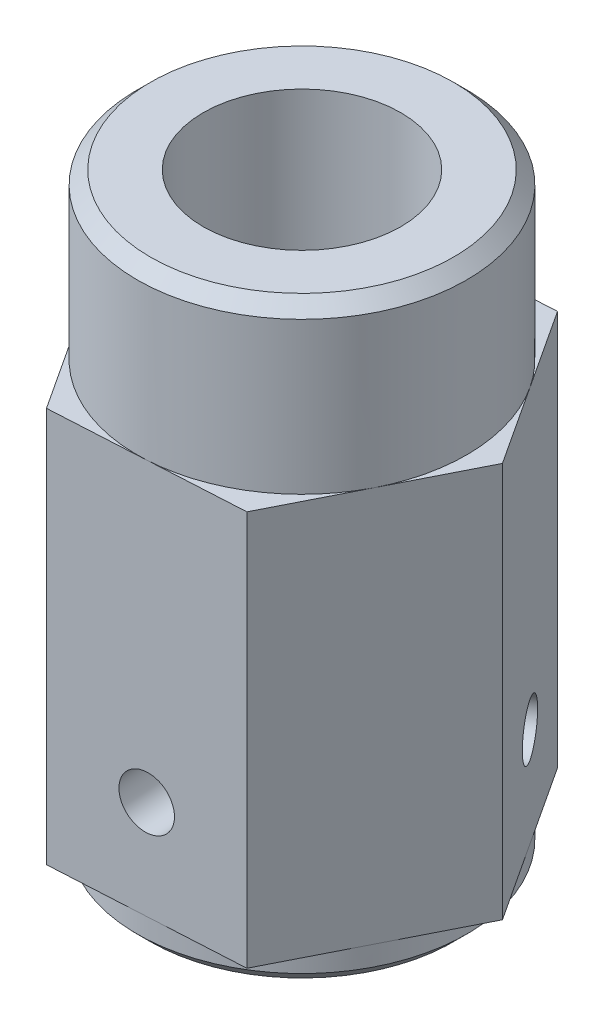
ISO-10303-21;
HEADER;
FILE_DESCRIPTION(('STEP AP214'),'2;1');
FILE_NAME('part.step','',(''),(''),'','','');
FILE_SCHEMA(('AUTOMOTIVE_DESIGN { 1 0 10303 214 1 1 1 1 }'));
ENDSEC;
DATA;
#1=APPLICATION_CONTEXT('core data for automotive mechanical design processes');
#2=APPLICATION_PROTOCOL_DEFINITION('international standard','automotive_design',2000,#1);
#3=PRODUCT_CONTEXT('',#1,'mechanical');
#4=PRODUCT('Part','Part','',(#3));
#5=PRODUCT_RELATED_PRODUCT_CATEGORY('part','',(#4));
#6=PRODUCT_DEFINITION_FORMATION('','',#4);
#7=PRODUCT_DEFINITION_CONTEXT('part definition',#1,'design');
#8=PRODUCT_DEFINITION('design','',#6,#7);
#9=PRODUCT_DEFINITION_SHAPE('','',#8);
#10=(LENGTH_UNIT() NAMED_UNIT(*) SI_UNIT(.MILLI.,.METRE.));
#11=(NAMED_UNIT(*) PLANE_ANGLE_UNIT() SI_UNIT($,.RADIAN.));
#12=(NAMED_UNIT(*) SI_UNIT($,.STERADIAN.) SOLID_ANGLE_UNIT());
#13=UNCERTAINTY_MEASURE_WITH_UNIT(LENGTH_MEASURE(1.E-05),#10,'distance_accuracy_value','');
#14=(GEOMETRIC_REPRESENTATION_CONTEXT(3) GLOBAL_UNCERTAINTY_ASSIGNED_CONTEXT((#13)) GLOBAL_UNIT_ASSIGNED_CONTEXT((#10,
#11,#12)) REPRESENTATION_CONTEXT('',''));
#15=CARTESIAN_POINT('',(0.,0.,0.));
#16=DIRECTION('',(0.,0.,1.));
#17=DIRECTION('',(1.,0.,0.));
#18=AXIS2_PLACEMENT_3D('',#15,#16,#17);
#19=CARTESIAN_POINT('',(0.,0.,0.));
#20=DIRECTION('',(0.,1.,0.));
#21=DIRECTION('',(0.,0.,1.));
#22=AXIS2_PLACEMENT_3D('',#19,#20,#21);
#23=PLANE('',#22);
#24=CARTESIAN_POINT('',(0.,0.,0.));
#25=DIRECTION('',(0.,-1.,0.));
#26=DIRECTION('',(0.,0.,-1.));
#27=AXIS2_PLACEMENT_3D('',#24,#25,#26);
#28=CIRCLE('',#27,25.);
#29=CARTESIAN_POINT('',(20.9230125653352,0.,-13.6831116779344));
#30=VERTEX_POINT('',#29);
#31=CARTESIAN_POINT('',(22.3114285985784,0.,11.2783045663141));
#32=VERTEX_POINT('',#31);
#33=EDGE_CURVE('E151',#30,#32,#28,.T.);
#34=ORIENTED_EDGE('',*,*,#33,.F.);
#35=DIRECTION('',(-0.547324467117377,0.,-0.836920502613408));
#36=VECTOR('',#35,1.);
#37=CARTESIAN_POINT('',(28.8229607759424,0.,-1.60320474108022));
#38=LINE('',#37,#36);
#39=CARTESIAN_POINT('',(28.8229607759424,0.,-1.60320474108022));
#40=VERTEX_POINT('',#39);
#41=EDGE_CURVE('E128',#40,#30,#38,.T.);
#42=ORIENTED_EDGE('',*,*,#41,.F.);
#43=DIRECTION('',(0.451132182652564,0.,-0.892457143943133));
#44=VECTOR('',#43,1.);
#45=CARTESIAN_POINT('',(15.7998964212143,0.,24.1598138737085));
#46=LINE('',#45,#44);
#47=EDGE_CURVE('E152',#32,#40,#46,.T.);
#48=ORIENTED_EDGE('',*,*,#47,.F.);
#49=EDGE_LOOP('',(#34,#42,#48));
#50=FACE_BOUND('',#49,.T.);
#51=ADVANCED_FACE('F36',(#50),#23,.F.);
#52=CARTESIAN_POINT('',(1.38841603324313,0.,24.9614162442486));
#53=VERTEX_POINT('',#52);
#54=EDGE_CURVE('E58',#32,#53,#28,.T.);
#55=ORIENTED_EDGE('',*,*,#54,.F.);
#56=CARTESIAN_POINT('',(15.7998964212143,0.,24.1598138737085));
#57=VERTEX_POINT('',#56);
#58=EDGE_CURVE('E149',#57,#32,#46,.T.);
#59=ORIENTED_EDGE('',*,*,#58,.F.);
#60=DIRECTION('',(0.998456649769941,0.,-0.055536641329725));
#61=VECTOR('',#60,1.);
#62=CARTESIAN_POINT('',(-13.0230643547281,0.,25.7630186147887));
#63=LINE('',#62,#61);
#64=EDGE_CURVE('E200',#53,#57,#63,.T.);
#65=ORIENTED_EDGE('',*,*,#64,.F.);
#66=EDGE_LOOP('',(#55,#59,#65));
#67=FACE_BOUND('',#66,.T.);
#68=ADVANCED_FACE('F261',(#67),#23,.F.);
#69=CARTESIAN_POINT('',(-20.9230125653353,0.,13.6831116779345));
#70=VERTEX_POINT('',#69);
#71=EDGE_CURVE('E51',#53,#70,#28,.T.);
#72=ORIENTED_EDGE('',*,*,#71,.F.);
#73=CARTESIAN_POINT('',(-13.0230643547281,0.,25.7630186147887));
#74=VERTEX_POINT('',#73);
#75=EDGE_CURVE('E201',#74,#53,#63,.T.);
#76=ORIENTED_EDGE('',*,*,#75,.F.);
#77=DIRECTION('',(0.547324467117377,0.,0.836920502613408));
#78=VECTOR('',#77,1.);
#79=CARTESIAN_POINT('',(-28.8229607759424,0.,1.60320474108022));
#80=LINE('',#79,#78);
#81=EDGE_CURVE('E171',#70,#74,#80,.T.);
#82=ORIENTED_EDGE('',*,*,#81,.F.);
#83=EDGE_LOOP('',(#72,#76,#82));
#84=FACE_BOUND('',#83,.T.);
#85=ADVANCED_FACE('F266',(#84),#23,.F.);
#86=CARTESIAN_POINT('',(-22.3114285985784,0.,-11.2783045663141));
#87=VERTEX_POINT('',#86);
#88=EDGE_CURVE('E163',#70,#87,#28,.T.);
#89=ORIENTED_EDGE('',*,*,#88,.F.);
#90=CARTESIAN_POINT('',(-28.8229607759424,0.,1.60320474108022));
#91=VERTEX_POINT('',#90);
#92=EDGE_CURVE('E197',#91,#70,#80,.T.);
#93=ORIENTED_EDGE('',*,*,#92,.F.);
#94=DIRECTION('',(-0.451132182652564,0.,0.892457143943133));
#95=VECTOR('',#94,1.);
#96=CARTESIAN_POINT('',(-15.7998964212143,0.,-24.1598138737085));
#97=LINE('',#96,#95);
#98=EDGE_CURVE('E206',#87,#91,#97,.T.);
#99=ORIENTED_EDGE('',*,*,#98,.F.);
#100=EDGE_LOOP('',(#89,#93,#99));
#101=FACE_BOUND('',#100,.T.);
#102=ADVANCED_FACE('F285',(#101),#23,.F.);
#103=CARTESIAN_POINT('',(-1.38841603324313,0.,-24.9614162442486));
#104=VERTEX_POINT('',#103);
#105=EDGE_CURVE('E161',#87,#104,#28,.T.);
#106=ORIENTED_EDGE('',*,*,#105,.F.);
#107=CARTESIAN_POINT('',(-15.7998964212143,0.,-24.1598138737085));
#108=VERTEX_POINT('',#107);
#109=EDGE_CURVE('E207',#108,#87,#97,.T.);
#110=ORIENTED_EDGE('',*,*,#109,.F.);
#111=DIRECTION('',(-0.99845664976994,0.,0.0555366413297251));
#112=VECTOR('',#111,1.);
#113=CARTESIAN_POINT('',(13.0230643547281,0.,-25.7630186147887));
#114=LINE('',#113,#112);
#115=EDGE_CURVE('E139',#104,#108,#114,.T.);
#116=ORIENTED_EDGE('',*,*,#115,.F.);
#117=EDGE_LOOP('',(#106,#110,#116));
#118=FACE_BOUND('',#117,.T.);
#119=ADVANCED_FACE('F272',(#118),#23,.F.);
#120=CARTESIAN_POINT('',(0.,60.,0.));
#121=DIRECTION('',(0.,1.,0.));
#122=DIRECTION('',(0.,0.,1.));
#123=AXIS2_PLACEMENT_3D('',#120,#121,#122);
#124=PLANE('',#123);
#125=CARTESIAN_POINT('',(0.,60.,0.));
#126=DIRECTION('',(0.,1.,0.));
#127=DIRECTION('',(0.,0.,1.));
#128=AXIS2_PLACEMENT_3D('',#125,#126,#127);
#129=CIRCLE('',#128,25.);
#130=CARTESIAN_POINT('',(1.38841603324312,60.,24.9614162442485));
#131=VERTEX_POINT('',#130);
#132=CARTESIAN_POINT('',(22.3114285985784,60.,11.2783045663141));
#133=VERTEX_POINT('',#132);
#134=EDGE_CURVE('E155',#131,#133,#129,.T.);
#135=ORIENTED_EDGE('',*,*,#134,.F.);
#136=DIRECTION('',(0.998456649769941,0.,-0.055536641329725));
#137=VECTOR('',#136,1.);
#138=CARTESIAN_POINT('',(-13.0230643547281,60.,25.7630186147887));
#139=LINE('',#138,#137);
#140=CARTESIAN_POINT('',(15.7998964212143,60.,24.1598138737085));
#141=VERTEX_POINT('',#140);
#142=EDGE_CURVE('E176',#131,#141,#139,.T.);
#143=ORIENTED_EDGE('',*,*,#142,.T.);
#144=DIRECTION('',(0.451132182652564,0.,-0.892457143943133));
#145=VECTOR('',#144,1.);
#146=CARTESIAN_POINT('',(15.7998964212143,60.,24.1598138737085));
#147=LINE('',#146,#145);
#148=EDGE_CURVE('E181',#141,#133,#147,.T.);
#149=ORIENTED_EDGE('',*,*,#148,.T.);
#150=EDGE_LOOP('',(#135,#143,#149));
#151=FACE_BOUND('',#150,.T.);
#152=ADVANCED_FACE('F282',(#151),#124,.T.);
#153=CARTESIAN_POINT('',(20.9230125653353,60.,-13.6831116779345));
#154=VERTEX_POINT('',#153);
#155=EDGE_CURVE('E162',#133,#154,#129,.T.);
#156=ORIENTED_EDGE('',*,*,#155,.F.);
#157=CARTESIAN_POINT('',(28.8229607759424,60.,-1.60320474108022));
#158=VERTEX_POINT('',#157);
#159=EDGE_CURVE('E180',#133,#158,#147,.T.);
#160=ORIENTED_EDGE('',*,*,#159,.T.);
#161=DIRECTION('',(-0.547324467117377,0.,-0.836920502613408));
#162=VECTOR('',#161,1.);
#163=CARTESIAN_POINT('',(28.8229607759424,60.,-1.60320474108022));
#164=LINE('',#163,#162);
#165=EDGE_CURVE('E185',#158,#154,#164,.T.);
#166=ORIENTED_EDGE('',*,*,#165,.T.);
#167=EDGE_LOOP('',(#156,#160,#166));
#168=FACE_BOUND('',#167,.T.);
#169=ADVANCED_FACE('F291',(#168),#124,.T.);
#170=CARTESIAN_POINT('',(-1.38841603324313,60.,-24.9614162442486));
#171=VERTEX_POINT('',#170);
#172=EDGE_CURVE('E165',#154,#171,#129,.T.);
#173=ORIENTED_EDGE('',*,*,#172,.F.);
#174=CARTESIAN_POINT('',(13.0230643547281,60.,-25.7630186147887));
#175=VERTEX_POINT('',#174);
#176=EDGE_CURVE('E184',#154,#175,#164,.T.);
#177=ORIENTED_EDGE('',*,*,#176,.T.);
#178=DIRECTION('',(-0.99845664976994,0.,0.0555366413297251));
#179=VECTOR('',#178,1.);
#180=CARTESIAN_POINT('',(13.0230643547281,60.,-25.7630186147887));
#181=LINE('',#180,#179);
#182=EDGE_CURVE('E189',#175,#171,#181,.T.);
#183=ORIENTED_EDGE('',*,*,#182,.T.);
#184=EDGE_LOOP('',(#173,#177,#183));
#185=FACE_BOUND('',#184,.T.);
#186=ADVANCED_FACE('F341',(#185),#124,.T.);
#187=CARTESIAN_POINT('',(-22.3114285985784,60.,-11.2783045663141));
#188=VERTEX_POINT('',#187);
#189=EDGE_CURVE('E343',#171,#188,#129,.T.);
#190=ORIENTED_EDGE('',*,*,#189,.F.);
#191=CARTESIAN_POINT('',(-15.7998964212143,60.,-24.1598138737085));
#192=VERTEX_POINT('',#191);
#193=EDGE_CURVE('E188',#171,#192,#181,.T.);
#194=ORIENTED_EDGE('',*,*,#193,.T.);
#195=DIRECTION('',(-0.451132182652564,0.,0.892457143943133));
#196=VECTOR('',#195,1.);
#197=CARTESIAN_POINT('',(-15.7998964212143,60.,-24.1598138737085));
#198=LINE('',#197,#196);
#199=EDGE_CURVE('E193',#192,#188,#198,.T.);
#200=ORIENTED_EDGE('',*,*,#199,.T.);
#201=EDGE_LOOP('',(#190,#194,#200));
#202=FACE_BOUND('',#201,.T.);
#203=ADVANCED_FACE('F349',(#202),#124,.T.);
#204=CARTESIAN_POINT('',(-20.9230125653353,60.,13.6831116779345));
#205=VERTEX_POINT('',#204);
#206=EDGE_CURVE('E344',#188,#205,#129,.T.);
#207=ORIENTED_EDGE('',*,*,#206,.F.);
#208=CARTESIAN_POINT('',(-28.8229607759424,60.,1.60320474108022));
#209=VERTEX_POINT('',#208);
#210=EDGE_CURVE('E192',#188,#209,#198,.T.);
#211=ORIENTED_EDGE('',*,*,#210,.T.);
#212=DIRECTION('',(0.547324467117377,0.,0.836920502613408));
#213=VECTOR('',#212,1.);
#214=CARTESIAN_POINT('',(-28.8229607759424,60.,1.60320474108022));
#215=LINE('',#214,#213);
#216=EDGE_CURVE('E173',#209,#205,#215,.T.);
#217=ORIENTED_EDGE('',*,*,#216,.T.);
#218=EDGE_LOOP('',(#207,#211,#217));
#219=FACE_BOUND('',#218,.T.);
#220=ADVANCED_FACE('F283',(#219),#124,.T.);
#221=CARTESIAN_POINT('',(-28.8229607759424,60.,1.60320474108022));
#222=DIRECTION('',(0.836920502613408,0.,-0.547324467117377));
#223=DIRECTION('',(-0.547324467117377,0.,-0.836920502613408));
#224=AXIS2_PLACEMENT_3D('',#221,#222,#223);
#225=PLANE('',#224);
#226=ORIENTED_EDGE('',*,*,#92,.T.);
#227=ORIENTED_EDGE('',*,*,#81,.T.);
#228=DIRECTION('',(0.,-1.,0.));
#229=VECTOR('',#228,1.);
#230=CARTESIAN_POINT('',(-13.0230643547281,60.,25.7630186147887));
#231=LINE('',#230,#229);
#232=CARTESIAN_POINT('',(-13.0230643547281,60.,25.7630186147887));
#233=VERTEX_POINT('',#232);
#234=EDGE_CURVE('E221',#233,#74,#231,.T.);
#235=ORIENTED_EDGE('',*,*,#234,.F.);
#236=EDGE_CURVE('E177',#205,#233,#215,.T.);
#237=ORIENTED_EDGE('',*,*,#236,.F.);
#238=ORIENTED_EDGE('',*,*,#216,.F.);
#239=DIRECTION('',(0.,-1.,0.));
#240=VECTOR('',#239,1.);
#241=CARTESIAN_POINT('',(-28.8229607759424,60.,1.60320474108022));
#242=LINE('',#241,#240);
#243=EDGE_CURVE('E196',#209,#91,#242,.T.);
#244=ORIENTED_EDGE('',*,*,#243,.T.);
#245=EDGE_LOOP('',(#226,#227,#235,#237,#238,#244));
#246=FACE_BOUND('',#245,.T.);
#247=ADVANCED_FACE('F368',(#246),#225,.F.);
#248=CARTESIAN_POINT('',(-13.0230643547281,60.,25.7630186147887));
#249=DIRECTION('',(-0.0555366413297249,0.,-0.99845664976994));
#250=DIRECTION('',(-0.99845664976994,0.,0.0555366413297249));
#251=AXIS2_PLACEMENT_3D('',#248,#249,#250);
#252=PLANE('',#251);
#253=CARTESIAN_POINT('',(1.38841603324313,15.,24.9614162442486));
#254=DIRECTION('',(0.0555366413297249,0.,0.99845664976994));
#255=DIRECTION('',(0.99845664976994,0.,-0.0555366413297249));
#256=AXIS2_PLACEMENT_3D('',#253,#254,#255);
#257=CIRCLE('',#256,4.);
#258=CARTESIAN_POINT('',(5.38224263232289,15.,24.7392696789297));
#259=VERTEX_POINT('',#258);
#260=EDGE_CURVE('E536',#259,#259,#257,.T.);
#261=ORIENTED_EDGE('',*,*,#260,.F.);
#262=EDGE_LOOP('',(#261));
#263=FACE_BOUND('',#262,.T.);
#264=ORIENTED_EDGE('',*,*,#75,.T.);
#265=ORIENTED_EDGE('',*,*,#64,.T.);
#266=DIRECTION('',(0.,-1.,0.));
#267=VECTOR('',#266,1.);
#268=CARTESIAN_POINT('',(15.7998964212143,60.,24.1598138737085));
#269=LINE('',#268,#267);
#270=EDGE_CURVE('E218',#141,#57,#269,.T.);
#271=ORIENTED_EDGE('',*,*,#270,.F.);
#272=ORIENTED_EDGE('',*,*,#142,.F.);
#273=EDGE_CURVE('E178',#233,#131,#139,.T.);
#274=ORIENTED_EDGE('',*,*,#273,.F.);
#275=ORIENTED_EDGE('',*,*,#234,.T.);
#276=EDGE_LOOP('',(#264,#265,#271,#272,#274,#275));
#277=FACE_BOUND('',#276,.T.);
#278=ADVANCED_FACE('F365',(#263,#277),#252,.F.);
#279=CARTESIAN_POINT('',(15.7998964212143,60.,24.1598138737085));
#280=DIRECTION('',(-0.892457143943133,0.,-0.451132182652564));
#281=DIRECTION('',(-0.451132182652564,0.,0.892457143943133));
#282=AXIS2_PLACEMENT_3D('',#279,#280,#281);
#283=PLANE('',#282);
#284=ORIENTED_EDGE('',*,*,#58,.T.);
#285=ORIENTED_EDGE('',*,*,#47,.T.);
#286=DIRECTION('',(0.,-1.,0.));
#287=VECTOR('',#286,1.);
#288=CARTESIAN_POINT('',(28.8229607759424,60.,-1.60320474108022));
#289=LINE('',#288,#287);
#290=EDGE_CURVE('E136',#158,#40,#289,.T.);
#291=ORIENTED_EDGE('',*,*,#290,.F.);
#292=ORIENTED_EDGE('',*,*,#159,.F.);
#293=ORIENTED_EDGE('',*,*,#148,.F.);
#294=ORIENTED_EDGE('',*,*,#270,.T.);
#295=EDGE_LOOP('',(#284,#285,#291,#292,#293,#294));
#296=FACE_BOUND('',#295,.T.);
#297=ADVANCED_FACE('F336',(#296),#283,.F.);
#298=CARTESIAN_POINT('',(28.8229607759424,60.,-1.60320474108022));
#299=DIRECTION('',(-0.836920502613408,0.,0.547324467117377));
#300=DIRECTION('',(0.547324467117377,0.,0.836920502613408));
#301=AXIS2_PLACEMENT_3D('',#298,#299,#300);
#302=PLANE('',#301);
#303=CARTESIAN_POINT('',(20.9230125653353,15.,-13.6831116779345));
#304=DIRECTION('',(0.836920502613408,0.,-0.547324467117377));
#305=DIRECTION('',(-0.547324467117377,0.,-0.836920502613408));
#306=AXIS2_PLACEMENT_3D('',#303,#304,#305);
#307=CIRCLE('',#306,4.);
#308=CARTESIAN_POINT('',(18.7337146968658,15.,-17.0307936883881));
#309=VERTEX_POINT('',#308);
#310=EDGE_CURVE('E533',#309,#309,#307,.T.);
#311=ORIENTED_EDGE('',*,*,#310,.F.);
#312=EDGE_LOOP('',(#311));
#313=FACE_BOUND('',#312,.T.);
#314=ORIENTED_EDGE('',*,*,#41,.T.);
#315=CARTESIAN_POINT('',(13.0230643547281,0.,-25.7630186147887));
#316=VERTEX_POINT('',#315);
#317=EDGE_CURVE('E132',#30,#316,#38,.T.);
#318=ORIENTED_EDGE('',*,*,#317,.T.);
#319=DIRECTION('',(0.,-1.,0.));
#320=VECTOR('',#319,1.);
#321=CARTESIAN_POINT('',(13.0230643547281,60.,-25.7630186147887));
#322=LINE('',#321,#320);
#323=EDGE_CURVE('E215',#175,#316,#322,.T.);
#324=ORIENTED_EDGE('',*,*,#323,.F.);
#325=ORIENTED_EDGE('',*,*,#176,.F.);
#326=ORIENTED_EDGE('',*,*,#165,.F.);
#327=ORIENTED_EDGE('',*,*,#290,.T.);
#328=EDGE_LOOP('',(#314,#318,#324,#325,#326,#327));
#329=FACE_BOUND('',#328,.T.);
#330=ADVANCED_FACE('F130',(#313,#329),#302,.F.);
#331=CARTESIAN_POINT('',(13.0230643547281,60.,-25.7630186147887));
#332=DIRECTION('',(0.0555366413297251,0.,0.99845664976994));
#333=DIRECTION('',(0.99845664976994,0.,-0.0555366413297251));
#334=AXIS2_PLACEMENT_3D('',#331,#332,#333);
#335=PLANE('',#334);
#336=EDGE_CURVE('E148',#316,#104,#114,.T.);
#337=ORIENTED_EDGE('',*,*,#336,.T.);
#338=ORIENTED_EDGE('',*,*,#115,.T.);
#339=DIRECTION('',(0.,-1.,0.));
#340=VECTOR('',#339,1.);
#341=CARTESIAN_POINT('',(-15.7998964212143,60.,-24.1598138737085));
#342=LINE('',#341,#340);
#343=EDGE_CURVE('E212',#192,#108,#342,.T.);
#344=ORIENTED_EDGE('',*,*,#343,.F.);
#345=ORIENTED_EDGE('',*,*,#193,.F.);
#346=ORIENTED_EDGE('',*,*,#182,.F.);
#347=ORIENTED_EDGE('',*,*,#323,.T.);
#348=EDGE_LOOP('',(#337,#338,#344,#345,#346,#347));
#349=FACE_BOUND('',#348,.T.);
#350=ADVANCED_FACE('F352',(#349),#335,.F.);
#351=CARTESIAN_POINT('',(-15.7998964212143,60.,-24.1598138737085));
#352=DIRECTION('',(0.892457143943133,0.,0.451132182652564));
#353=DIRECTION('',(0.451132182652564,0.,-0.892457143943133));
#354=AXIS2_PLACEMENT_3D('',#351,#352,#353);
#355=PLANE('',#354);
#356=CARTESIAN_POINT('',(-22.3114285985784,15.,-11.2783045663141));
#357=DIRECTION('',(-0.892457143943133,0.,-0.451132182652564));
#358=DIRECTION('',(-0.451132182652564,0.,0.892457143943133));
#359=AXIS2_PLACEMENT_3D('',#356,#357,#358);
#360=CIRCLE('',#359,4.);
#361=CARTESIAN_POINT('',(-24.1159573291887,15.,-7.7084759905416));
#362=VERTEX_POINT('',#361);
#363=EDGE_CURVE('E232',#362,#362,#360,.T.);
#364=ORIENTED_EDGE('',*,*,#363,.F.);
#365=EDGE_LOOP('',(#364));
#366=FACE_BOUND('',#365,.T.);
#367=ORIENTED_EDGE('',*,*,#109,.T.);
#368=ORIENTED_EDGE('',*,*,#98,.T.);
#369=ORIENTED_EDGE('',*,*,#243,.F.);
#370=ORIENTED_EDGE('',*,*,#210,.F.);
#371=ORIENTED_EDGE('',*,*,#199,.F.);
#372=ORIENTED_EDGE('',*,*,#343,.T.);
#373=EDGE_LOOP('',(#367,#368,#369,#370,#371,#372));
#374=FACE_BOUND('',#373,.T.);
#375=ADVANCED_FACE('F280',(#366,#374),#355,.F.);
#376=EDGE_CURVE('E172',#205,#131,#129,.T.);
#377=ORIENTED_EDGE('',*,*,#376,.F.);
#378=ORIENTED_EDGE('',*,*,#236,.T.);
#379=ORIENTED_EDGE('',*,*,#273,.T.);
#380=EDGE_LOOP('',(#377,#378,#379));
#381=FACE_BOUND('',#380,.T.);
#382=ADVANCED_FACE('F271',(#381),#124,.T.);
#383=EDGE_CURVE('E145',#104,#30,#28,.T.);
#384=ORIENTED_EDGE('',*,*,#383,.F.);
#385=ORIENTED_EDGE('',*,*,#336,.F.);
#386=ORIENTED_EDGE('',*,*,#317,.F.);
#387=EDGE_LOOP('',(#384,#385,#386));
#388=FACE_BOUND('',#387,.T.);
#389=ADVANCED_FACE('F143',(#388),#23,.F.);
#390=CARTESIAN_POINT('',(0.,85.,0.));
#391=DIRECTION('',(0.,-1.,0.));
#392=DIRECTION('',(0.,0.,-1.));
#393=AXIS2_PLACEMENT_3D('',#390,#391,#392);
#394=CYLINDRICAL_SURFACE('',#393,25.);
#395=CARTESIAN_POINT('',(0.,83.,0.));
#396=DIRECTION('',(0.,1.,0.));
#397=DIRECTION('',(0.,0.,1.));
#398=AXIS2_PLACEMENT_3D('',#395,#396,#397);
#399=CIRCLE('',#398,25.);
#400=CARTESIAN_POINT('',(0.,83.,25.));
#401=VERTEX_POINT('',#400);
#402=EDGE_CURVE('E11',#401,#401,#399,.F.);
#403=ORIENTED_EDGE('',*,*,#402,.T.);
#404=EDGE_LOOP('',(#403));
#405=FACE_BOUND('',#404,.T.);
#406=ORIENTED_EDGE('',*,*,#134,.T.);
#407=ORIENTED_EDGE('',*,*,#155,.T.);
#408=ORIENTED_EDGE('',*,*,#172,.T.);
#409=ORIENTED_EDGE('',*,*,#189,.T.);
#410=ORIENTED_EDGE('',*,*,#206,.T.);
#411=ORIENTED_EDGE('',*,*,#376,.T.);
#412=EDGE_LOOP('',(#406,#407,#408,#409,#410,#411));
#413=FACE_BOUND('',#412,.T.);
#414=ADVANCED_FACE('F270',(#405,#413),#394,.T.);
#415=CARTESIAN_POINT('',(0.,85.,0.));
#416=DIRECTION('',(0.,1.,0.));
#417=DIRECTION('',(0.,0.,1.));
#418=AXIS2_PLACEMENT_3D('',#415,#416,#417);
#419=PLANE('',#418);
#420=CARTESIAN_POINT('',(0.,85.,0.));
#421=DIRECTION('',(0.,1.,0.));
#422=DIRECTION('',(0.,0.,1.));
#423=AXIS2_PLACEMENT_3D('',#420,#421,#422);
#424=CIRCLE('',#423,23.);
#425=CARTESIAN_POINT('',(0.,85.,23.));
#426=VERTEX_POINT('',#425);
#427=EDGE_CURVE('E44',#426,#426,#424,.T.);
#428=ORIENTED_EDGE('',*,*,#427,.T.);
#429=EDGE_LOOP('',(#428));
#430=FACE_BOUND('',#429,.T.);
#431=CARTESIAN_POINT('',(0.,85.,0.));
#432=DIRECTION('',(0.,1.,0.));
#433=DIRECTION('',(0.,0.,1.));
#434=AXIS2_PLACEMENT_3D('',#431,#432,#433);
#435=CIRCLE('',#434,15.);
#436=CARTESIAN_POINT('',(0.,85.,15.));
#437=VERTEX_POINT('',#436);
#438=EDGE_CURVE('E231',#437,#437,#435,.T.);
#439=ORIENTED_EDGE('',*,*,#438,.F.);
#440=EDGE_LOOP('',(#439));
#441=FACE_BOUND('',#440,.T.);
#442=ADVANCED_FACE('F277',(#430,#441),#419,.T.);
#443=CARTESIAN_POINT('',(0.,-5.,0.));
#444=DIRECTION('',(0.,1.,0.));
#445=DIRECTION('',(0.,0.,1.));
#446=AXIS2_PLACEMENT_3D('',#443,#444,#445);
#447=CYLINDRICAL_SURFACE('',#446,25.);
#448=CARTESIAN_POINT('',(0.,-2.99999999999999,0.));
#449=DIRECTION('',(0.,-1.,0.));
#450=DIRECTION('',(0.,0.,-1.));
#451=AXIS2_PLACEMENT_3D('',#448,#449,#450);
#452=CIRCLE('',#451,25.);
#453=CARTESIAN_POINT('',(0.,-2.99999999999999,-25.));
#454=VERTEX_POINT('',#453);
#455=EDGE_CURVE('E303',#454,#454,#452,.F.);
#456=ORIENTED_EDGE('',*,*,#455,.T.);
#457=EDGE_LOOP('',(#456));
#458=FACE_BOUND('',#457,.T.);
#459=ORIENTED_EDGE('',*,*,#33,.T.);
#460=ORIENTED_EDGE('',*,*,#54,.T.);
#461=ORIENTED_EDGE('',*,*,#71,.T.);
#462=ORIENTED_EDGE('',*,*,#88,.T.);
#463=ORIENTED_EDGE('',*,*,#105,.T.);
#464=ORIENTED_EDGE('',*,*,#383,.T.);
#465=EDGE_LOOP('',(#459,#460,#461,#462,#463,#464));
#466=FACE_BOUND('',#465,.T.);
#467=ADVANCED_FACE('F159',(#458,#466),#447,.T.);
#468=CARTESIAN_POINT('',(0.,-5.,0.));
#469=DIRECTION('',(0.,-1.,0.));
#470=DIRECTION('',(0.,0.,-1.));
#471=AXIS2_PLACEMENT_3D('',#468,#469,#470);
#472=PLANE('',#471);
#473=CARTESIAN_POINT('',(0.,-5.,0.));
#474=DIRECTION('',(0.,-1.,0.));
#475=DIRECTION('',(0.,0.,-1.));
#476=AXIS2_PLACEMENT_3D('',#473,#474,#475);
#477=CIRCLE('',#476,23.);
#478=CARTESIAN_POINT('',(0.,-5.,-23.));
#479=VERTEX_POINT('',#478);
#480=EDGE_CURVE('E301',#479,#479,#477,.T.);
#481=ORIENTED_EDGE('',*,*,#480,.T.);
#482=EDGE_LOOP('',(#481));
#483=FACE_BOUND('',#482,.T.);
#484=CARTESIAN_POINT('',(0.,-5.,0.));
#485=DIRECTION('',(0.,-1.,0.));
#486=DIRECTION('',(0.,0.,-1.));
#487=AXIS2_PLACEMENT_3D('',#484,#485,#486);
#488=CIRCLE('',#487,12.5);
#489=CARTESIAN_POINT('',(0.,-5.,-12.5));
#490=VERTEX_POINT('',#489);
#491=EDGE_CURVE('E156',#490,#490,#488,.T.);
#492=ORIENTED_EDGE('',*,*,#491,.F.);
#493=EDGE_LOOP('',(#492));
#494=FACE_BOUND('',#493,.T.);
#495=ADVANCED_FACE('F466',(#483,#494),#472,.T.);
#496=CARTESIAN_POINT('',(0.,40.,0.));
#497=DIRECTION('',(0.,-1.,0.));
#498=DIRECTION('',(0.,0.,-1.));
#499=AXIS2_PLACEMENT_3D('',#496,#497,#498);
#500=CYLINDRICAL_SURFACE('',#499,12.5);
#501=CARTESIAN_POINT('',(4.65153145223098,15.,11.6022952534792));
#502=CARTESIAN_POINT('',(4.65153085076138,15.2184155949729,11.6022959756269));
#503=CARTESIAN_POINT('',(4.6339482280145,15.4368387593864,11.609391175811));
#504=CARTESIAN_POINT('',(4.56426617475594,15.8672489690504,11.6369601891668));
#505=CARTESIAN_POINT('',(4.51215873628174,16.0792345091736,11.6574371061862));
#506=CARTESIAN_POINT('',(4.37533302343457,16.4904702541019,11.7094730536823));
#507=CARTESIAN_POINT('',(4.29067462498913,16.6897430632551,11.7410117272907));
#508=CARTESIAN_POINT('',(4.0912280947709,17.0710441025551,11.8119861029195));
#509=CARTESIAN_POINT('',(3.97643415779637,17.2530690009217,11.8514233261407));
#510=CARTESIAN_POINT('',(3.71539388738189,17.6012659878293,11.9358799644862));
#511=CARTESIAN_POINT('',(3.56824212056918,17.7667254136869,11.9810397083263));
#512=CARTESIAN_POINT('',(3.24839444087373,18.0707160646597,12.0716829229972));
#513=CARTESIAN_POINT('',(3.0756947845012,18.2092433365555,12.1171664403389));
#514=CARTESIAN_POINT('',(2.7043980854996,18.45861346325,12.2054679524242));
#515=CARTESIAN_POINT('',(2.505281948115,18.5687178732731,12.2481965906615));
#516=CARTESIAN_POINT('',(2.08974422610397,18.7532464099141,12.325890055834));
#517=CARTESIAN_POINT('',(1.87332693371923,18.8276793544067,12.3608568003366));
#518=CARTESIAN_POINT('',(1.436641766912,18.9363594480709,12.4190576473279));
#519=CARTESIAN_POINT('',(1.21672339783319,18.971825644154,12.4426338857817));
#520=CARTESIAN_POINT('',(0.773142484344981,19.0054327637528,12.4780489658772));
#521=CARTESIAN_POINT('',(0.549480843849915,19.0035825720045,12.4898906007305));
#522=CARTESIAN_POINT('',(0.113362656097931,18.9634012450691,12.5013218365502));
#523=CARTESIAN_POINT('',(-0.0992065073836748,18.9263925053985,12.5013392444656));
#524=CARTESIAN_POINT('',(-0.515502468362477,18.8191204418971,12.4911022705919));
#525=CARTESIAN_POINT('',(-0.71922867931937,18.7488549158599,12.4808472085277));
#526=CARTESIAN_POINT('',(-1.11497585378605,18.5762419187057,12.4517760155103));
#527=CARTESIAN_POINT('',(-1.30681736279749,18.473502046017,12.4328538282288));
#528=CARTESIAN_POINT('',(-1.67125704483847,18.2391744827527,12.3891338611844));
#529=CARTESIAN_POINT('',(-1.84385015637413,18.1075792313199,12.3643345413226));
#530=CARTESIAN_POINT('',(-2.17271092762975,17.8125308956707,12.3109018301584));
#531=CARTESIAN_POINT('',(-2.32793889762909,17.6479390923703,12.2821484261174));
#532=CARTESIAN_POINT('',(-2.60883948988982,17.2950293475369,12.2255691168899));
#533=CARTESIAN_POINT('',(-2.73450826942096,17.1067083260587,12.1977433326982));
#534=CARTESIAN_POINT('',(-2.95387096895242,16.7086081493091,12.1465033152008));
#535=CARTESIAN_POINT('',(-3.04715521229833,16.498594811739,12.1231471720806));
#536=CARTESIAN_POINT('',(-3.1962000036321,16.0649479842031,12.084713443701));
#537=CARTESIAN_POINT('',(-3.25197481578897,15.8413197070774,12.069632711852));
#538=CARTESIAN_POINT('',(-3.32223153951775,15.3968402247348,12.0504794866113));
#539=CARTESIAN_POINT('',(-3.33834711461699,15.1762658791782,12.0459718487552));
#540=CARTESIAN_POINT('',(-3.33340240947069,14.7355893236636,12.0473417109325));
#541=CARTESIAN_POINT('',(-3.31234821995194,14.515487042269,12.0532175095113));
#542=CARTESIAN_POINT('',(-3.23516026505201,14.0890574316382,12.0741556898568));
#543=CARTESIAN_POINT('',(-3.18012666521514,13.8825146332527,12.0889296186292));
#544=CARTESIAN_POINT('',(-3.03792501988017,13.4814721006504,12.1254428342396));
#545=CARTESIAN_POINT('',(-2.95075156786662,13.2869743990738,12.1471832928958));
#546=CARTESIAN_POINT('',(-2.74390635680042,12.9091303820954,12.1955954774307));
#547=CARTESIAN_POINT('',(-2.62334415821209,12.7262886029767,12.222394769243));
#548=CARTESIAN_POINT('',(-2.35433756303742,12.3825664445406,12.2770477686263));
#549=CARTESIAN_POINT('',(-2.20588557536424,12.2216920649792,12.3049017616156));
#550=CARTESIAN_POINT('',(-1.87775525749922,11.9192022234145,12.359321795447));
#551=CARTESIAN_POINT('',(-1.6969945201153,11.7787379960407,12.3857780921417));
#552=CARTESIAN_POINT('',(-1.313879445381,11.5297873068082,12.4322524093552));
#553=CARTESIAN_POINT('',(-1.11152603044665,11.4212994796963,12.4522707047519));
#554=CARTESIAN_POINT('',(-0.692287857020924,11.2404100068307,12.4825695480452));
#555=CARTESIAN_POINT('',(-0.475517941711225,11.1677547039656,12.4929190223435));
#556=CARTESIAN_POINT('',(-0.0326108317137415,11.0600397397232,12.5019165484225));
#557=CARTESIAN_POINT('',(0.193523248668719,11.0249676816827,12.5005684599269));
#558=CARTESIAN_POINT('',(0.638116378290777,10.9944607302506,12.4855971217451));
#559=CARTESIAN_POINT('',(0.856480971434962,10.9973667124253,12.4725108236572));
#560=CARTESIAN_POINT('',(1.28884091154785,11.0386927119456,12.4352709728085));
#561=CARTESIAN_POINT('',(1.50283656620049,11.0771102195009,12.4111182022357));
#562=CARTESIAN_POINT('',(1.91755534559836,11.1872956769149,12.3537950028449));
#563=CARTESIAN_POINT('',(2.11841983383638,11.2586009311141,12.3207522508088));
#564=CARTESIAN_POINT('',(2.50501057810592,11.4321165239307,12.2480061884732));
#565=CARTESIAN_POINT('',(2.69073417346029,11.5343322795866,12.2083017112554));
#566=CARTESIAN_POINT('',(3.04897071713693,11.7709027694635,12.1238956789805));
#567=CARTESIAN_POINT('',(3.22079279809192,11.906258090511,12.0790677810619));
#568=CARTESIAN_POINT('',(3.53976639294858,12.2035231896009,11.9894768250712));
#569=CARTESIAN_POINT('',(3.68691032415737,12.3654410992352,11.9447137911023));
#570=CARTESIAN_POINT('',(3.95775486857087,12.7180666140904,11.8577886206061));
#571=CARTESIAN_POINT('',(4.080446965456,12.9095875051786,11.8157736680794));
#572=CARTESIAN_POINT('',(4.29218812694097,13.3119617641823,11.7405202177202));
#573=CARTESIAN_POINT('',(4.38124914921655,13.5228082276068,11.7072786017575));
#574=CARTESIAN_POINT('',(4.51780510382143,13.9424571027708,11.6552310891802));
#575=CARTESIAN_POINT('',(4.56780628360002,14.1503378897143,11.635566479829));
#576=CARTESIAN_POINT('',(4.63466513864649,14.5721444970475,11.6090999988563));
#577=CARTESIAN_POINT('',(4.65153204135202,14.7860686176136,11.6022945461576));
#578=CARTESIAN_POINT('',(4.65153145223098,15.,11.6022952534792));
#579=B_SPLINE_CURVE_WITH_KNOTS('',3,(#501,#502,#503,#504,#505,#506,#507,#508,#509,#510,#511,
#512,#513,#514,#515,#516,#517,#518,#519,#520,#521,#522,#523,#524,#525,#526,#527,#528,#529,#530,
#531,#532,#533,#534,#535,#536,#537,#538,#539,#540,#541,#542,#543,#544,#545,#546,#547,#548,#549,
#550,#551,#552,#553,#554,#555,#556,#557,#558,#559,#560,#561,#562,#563,#564,#565,#566,#567,#568,
#569,#570,#571,#572,#573,#574,#575,#576,#577,#578),.UNSPECIFIED.,.T.,.F.,(4,2,2,2,2,2,2,2,2,2,2,
2,2,2,2,2,2,2,2,2,2,2,2,2,2,2,2,2,2,2,2,2,2,2,2,2,2,2,4),(0.,0.654455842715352,1.309063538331,
1.96247283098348,2.6160080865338,3.29090543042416,3.96590176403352,4.65698443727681,
5.34789618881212,6.01651686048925,6.68497834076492,7.32925318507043,7.9735706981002,
8.62599225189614,9.27858496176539,9.95962670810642,10.6407569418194,11.3302140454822,
12.0194088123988,12.6796997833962,13.3398825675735,13.979736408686,14.6196979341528,
15.2787163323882,15.9379143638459,16.6259668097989,17.3139898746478,17.9970699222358,
18.6799245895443,19.3330513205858,19.9861318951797,20.6302921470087,21.2745653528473,
21.9414122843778,22.6084637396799,23.2990150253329,23.9893205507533,24.6305185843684,
25.2715380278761),.UNSPECIFIED.);
#580=CARTESIAN_POINT('',(4.65153145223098,15.,11.6022952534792));
#581=VERTEX_POINT('',#580);
#582=EDGE_CURVE('E309',#581,#581,#579,.T.);
#583=ORIENTED_EDGE('',*,*,#582,.T.);
#584=EDGE_LOOP('',(#583));
#585=FACE_BOUND('',#584,.T.);
#586=CARTESIAN_POINT('',(7.72211670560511,15.,-9.82949203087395));
#587=CARTESIAN_POINT('',(7.72211763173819,15.2184155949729,-9.82949187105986));
#588=CARTESIAN_POINT('',(7.73705356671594,15.4368387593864,-9.81781247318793));
#589=CARTESIAN_POINT('',(7.79577005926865,15.8672489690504,-9.77125055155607));
#590=CARTESIAN_POINT('',(7.83955730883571,16.0792345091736,-9.73636264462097));
#591=CARTESIAN_POINT('',(7.95303461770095,16.4904702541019,-9.64388607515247));
#592=CARTESIAN_POINT('',(8.02267710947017,16.6897430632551,-9.58633908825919));
#593=CARTESIAN_POINT('',(8.18386598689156,17.0710441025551,-9.44910051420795));
#594=CARTESIAN_POINT('',(8.27541659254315,17.2530690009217,-9.36940466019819));
#595=CARTESIAN_POINT('',(8.47907832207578,17.6012659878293,-9.18556547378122));
#596=CARTESIAN_POINT('',(8.59176369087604,17.7667254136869,-9.08070817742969));
#597=CARTESIAN_POINT('',(8.83018685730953,18.0707160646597,-8.84903356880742));
#598=CARTESIAN_POINT('',(8.95592656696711,18.2092433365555,-8.72221303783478));
#599=CARTESIAN_POINT('',(9.21804626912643,18.45861346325,-8.44481142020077));
#600=CARTESIAN_POINT('',(9.35460842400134,18.5687178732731,-8.29373610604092));
#601=CARTESIAN_POINT('',(9.62966179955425,18.7532464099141,-7.97271661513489));
#602=CARTESIAN_POINT('',(9.76815253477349,18.8276793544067,-7.80277711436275));
#603=CARTESIAN_POINT('',(10.0368985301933,18.9363594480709,-7.45369708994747));
#604=CARTESIAN_POINT('',(10.1672753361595,18.971825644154,-7.27503031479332));
#605=CARTESIAN_POINT('',(10.4197361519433,19.0054327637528,-6.90858551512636));
#606=CARTESIAN_POINT('',(10.5418221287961,19.0035825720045,-6.72080967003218));
#607=CARTESIAN_POINT('',(10.7697809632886,18.9634012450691,-6.34883585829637));
#608=CARTESIAN_POINT('',(10.8760806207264,18.9263925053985,-6.16475426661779));
#609=CARTESIAN_POINT('',(11.0753631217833,18.8191204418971,-5.79911290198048));
#610=CARTESIAN_POINT('',(11.1683450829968,18.7488549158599,-5.61755329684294));
#611=CARTESIAN_POINT('',(11.3410422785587,18.5762419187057,-5.26029059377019));
#612=CARTESIAN_POINT('',(11.4205759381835,18.473502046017,-5.08468987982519));
#613=CARTESIAN_POINT('',(11.5649331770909,18.2391744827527,-4.74721587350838));
#614=CARTESIAN_POINT('',(11.6297528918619,18.1075792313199,-4.5853461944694));
#615=CARTESIAN_POINT('',(11.7479091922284,17.8125308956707,-4.27382805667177));
#616=CARTESIAN_POINT('',(11.8006219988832,17.6479390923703,-4.12501998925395));
#617=CARTESIAN_POINT('',(11.892073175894,17.2950293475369,-3.85346328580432));
#618=CARTESIAN_POINT('',(11.9308097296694,17.1067083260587,-3.73071803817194));
#619=CARTESIAN_POINT('',(11.996115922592,16.7086081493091,-3.51512435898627));
#620=CARTESIAN_POINT('',(12.0225310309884,16.498594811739,-3.42265976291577));
#621=CARTESIAN_POINT('',(12.0637688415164,16.0649479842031,-3.27436632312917));
#622=CARTESIAN_POINT('',(12.078595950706,15.8413197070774,-3.21852355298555));
#623=CARTESIAN_POINT('',(12.0971371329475,15.3968402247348,-3.14810283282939));
#624=CARTESIAN_POINT('',(12.1012911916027,15.1762658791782,-3.1318925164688));
#625=CARTESIAN_POINT('',(12.1000051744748,14.7355893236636,-3.13685968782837));
#626=CARTESIAN_POINT('',(12.0945666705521,14.515487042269,-3.15803105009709));
#627=CARTESIAN_POINT('',(12.0741056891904,14.0890574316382,-3.23534687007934));
#628=CARTESIAN_POINT('',(12.0593834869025,13.8825146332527,-3.29039432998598));
#629=CARTESIAN_POINT('',(12.0199040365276,13.4814721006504,-3.43180117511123));
#630=CARTESIAN_POINT('',(11.995145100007,13.2869743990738,-3.51816582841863));
#631=CARTESIAN_POINT('',(11.9336486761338,12.9091303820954,-3.72150512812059));
#632=CARTESIAN_POINT('',(11.8965764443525,12.7262886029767,-3.83931470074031));
#633=CARTESIAN_POINT('',(11.8094040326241,12.3825664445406,-4.09960774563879));
#634=CARTESIAN_POINT('',(11.7593003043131,12.2216920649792,-4.24209793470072));
#635=CARTESIAN_POINT('',(11.6423642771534,11.9192022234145,-4.55347714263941));
#636=CARTESIAN_POINT('',(11.5748957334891,11.7787379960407,-4.72324868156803));
#637=CARTESIAN_POINT('',(11.4235861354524,11.5297873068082,-5.07827322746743));
#638=CARTESIAN_POINT('',(11.3397457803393,11.4212994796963,-5.26352557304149));
#639=CARTESIAN_POINT('',(11.1563662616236,11.2404100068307,-5.64174590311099));
#640=CARTESIAN_POINT('',(11.056944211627,11.1677547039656,-5.83464889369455));
#641=CARTESIAN_POINT('',(10.8432827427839,11.0600397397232,-6.22271646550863));
#642=CARTESIAN_POINT('',(10.7290482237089,11.0249676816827,-6.41788027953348));
#643=CARTESIAN_POINT('',(10.4937860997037,10.9944607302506,-6.79542355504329));
#644=CARTESIAN_POINT('',(10.373270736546,10.9973667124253,-6.97798969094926));
#645=CARTESIAN_POINT('',(10.1248401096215,11.0386927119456,-7.3338044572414));
#646=CARTESIAN_POINT('',(9.9969253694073,11.0771102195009,-7.50705374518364));
#647=CARTESIAN_POINT('',(9.73992263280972,11.1872956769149,-7.83754914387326));
#648=CARTESIAN_POINT('',(9.61087452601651,11.2586009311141,-7.99498151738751));
#649=CARTESIAN_POINT('',(9.35457921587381,11.4321165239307,-8.29340589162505));
#650=CARTESIAN_POINT('',(9.22733233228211,11.5343322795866,-8.43439500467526));
#651=CARTESIAN_POINT('',(8.97511629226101,11.7709027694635,-8.70243393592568));
#652=CARTESIAN_POINT('',(8.85038315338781,11.906258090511,-8.82882227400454));
#653=CARTESIAN_POINT('',(8.61330831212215,12.2035231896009,-9.06026603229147));
#654=CARTESIAN_POINT('',(8.50097042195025,12.3654410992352,-9.16531489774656));
#655=CARTESIAN_POINT('',(8.29026874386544,12.7180666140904,-9.35641056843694));
#656=CARTESIAN_POINT('',(8.19253667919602,12.9095875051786,-9.44165756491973));
#657=CARTESIAN_POINT('',(8.02149469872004,13.3119617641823,-9.58740406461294));
#658=CARTESIAN_POINT('',(7.94817610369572,13.5228082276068,-9.64791236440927));
#659=CARTESIAN_POINT('',(7.83482365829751,13.9424571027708,-9.74014953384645));
#660=CARTESIAN_POINT('',(7.7927930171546,14.1503378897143,-9.77361952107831));
#661=CARTESIAN_POINT('',(7.73644294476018,14.5721444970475,-9.81828774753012));
#662=CARTESIAN_POINT('',(7.72211579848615,14.7860686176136,-9.82949218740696));
#663=CARTESIAN_POINT('',(7.72211670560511,15.,-9.82949203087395));
#664=B_SPLINE_CURVE_WITH_KNOTS('',3,(#586,#587,#588,#589,#590,#591,#592,#593,#594,#595,#596,
#597,#598,#599,#600,#601,#602,#603,#604,#605,#606,#607,#608,#609,#610,#611,#612,#613,#614,#615,
#616,#617,#618,#619,#620,#621,#622,#623,#624,#625,#626,#627,#628,#629,#630,#631,#632,#633,#634,
#635,#636,#637,#638,#639,#640,#641,#642,#643,#644,#645,#646,#647,#648,#649,#650,#651,#652,#653,
#654,#655,#656,#657,#658,#659,#660,#661,#662,#663),.UNSPECIFIED.,.T.,.F.,(4,2,2,2,2,2,2,2,2,2,2,
2,2,2,2,2,2,2,2,2,2,2,2,2,2,2,2,2,2,2,2,2,2,2,2,2,2,2,4),(0.,0.654455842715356,1.309063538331,
1.96247283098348,2.6160080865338,3.29090543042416,3.96590176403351,4.65698443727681,
5.34789618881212,6.01651686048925,6.68497834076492,7.32925318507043,7.9735706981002,
8.62599225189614,9.27858496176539,9.95962670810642,10.6407569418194,11.3302140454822,
12.0194088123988,12.6796997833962,13.3398825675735,13.979736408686,14.6196979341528,
15.2787163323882,15.9379143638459,16.6259668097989,17.3139898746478,17.9970699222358,
18.6799245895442,19.3330513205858,19.9861318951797,20.6302921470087,21.2745653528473,
21.9414122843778,22.6084637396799,23.2990150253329,23.9893205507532,24.6305185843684,
25.2715380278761),.UNSPECIFIED.);
#665=CARTESIAN_POINT('',(7.72211670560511,15.,-9.82949203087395));
#666=VERTEX_POINT('',#665);
#667=EDGE_CURVE('E233',#666,#666,#664,.T.);
#668=ORIENTED_EDGE('',*,*,#667,.T.);
#669=EDGE_LOOP('',(#668));
#670=FACE_BOUND('',#669,.T.);
#671=CARTESIAN_POINT('',(-12.3736481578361,15.,-1.77280322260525));
#672=CARTESIAN_POINT('',(-12.3736484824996,15.2184155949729,-1.77280410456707));
#673=CARTESIAN_POINT('',(-12.3710017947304,15.4368387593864,-1.79157870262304));
#674=CARTESIAN_POINT('',(-12.3600362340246,15.8672489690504,-1.86570963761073));
#675=CARTESIAN_POINT('',(-12.3517160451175,16.0792345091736,-1.92107446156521));
#676=CARTESIAN_POINT('',(-12.3283676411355,16.4904702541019,-2.06558697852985));
#677=CARTESIAN_POINT('',(-12.3133517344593,16.6897430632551,-2.15467263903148));
#678=CARTESIAN_POINT('',(-12.2750940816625,17.0710441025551,-2.36288558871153));
#679=CARTESIAN_POINT('',(-12.2518507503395,17.2530690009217,-2.48201866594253));
#680=CARTESIAN_POINT('',(-12.1944722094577,17.6012659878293,-2.75031449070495));
#681=CARTESIAN_POINT('',(-12.1600058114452,17.7667254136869,-2.90033153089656));
#682=CARTESIAN_POINT('',(-12.0785812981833,18.0707160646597,-3.22264935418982));
#683=CARTESIAN_POINT('',(-12.0316213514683,18.2092433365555,-3.39495340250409));
#684=CARTESIAN_POINT('',(-11.922444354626,18.45861346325,-3.76065653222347));
#685=CARTESIAN_POINT('',(-11.8598903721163,18.5687178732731,-3.95446048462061));
#686=CARTESIAN_POINT('',(-11.7194060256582,18.7532464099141,-4.35317344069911));
#687=CARTESIAN_POINT('',(-11.6414794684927,18.8276793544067,-4.55807968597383));
#688=CARTESIAN_POINT('',(-11.4735402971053,18.9363594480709,-4.96536055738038));
#689=CARTESIAN_POINT('',(-11.3839987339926,18.971825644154,-5.1676035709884));
#690=CARTESIAN_POINT('',(-11.1928786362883,19.0054327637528,-5.56946345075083));
#691=CARTESIAN_POINT('',(-11.091302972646,19.0035825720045,-5.76908093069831));
#692=CARTESIAN_POINT('',(-10.8831436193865,18.9634012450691,-6.1524859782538));
#693=CARTESIAN_POINT('',(-10.7768741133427,18.9263925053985,-6.33658497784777));
#694=CARTESIAN_POINT('',(-10.5598606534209,18.8191204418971,-6.69198936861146));
#695=CARTESIAN_POINT('',(-10.4491164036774,18.7488549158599,-6.86329391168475));
#696=CARTESIAN_POINT('',(-10.2260664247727,18.5762419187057,-7.19148542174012));
#697=CARTESIAN_POINT('',(-10.113758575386,18.473502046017,-7.34816394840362));
#698=CARTESIAN_POINT('',(-9.89367613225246,18.2391744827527,-7.64191798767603));
#699=CARTESIAN_POINT('',(-9.78590273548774,18.1075792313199,-7.77898834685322));
#700=CARTESIAN_POINT('',(-9.57519826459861,17.8125308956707,-8.0370737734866));
#701=CARTESIAN_POINT('',(-9.47268310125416,17.6479390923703,-8.15712843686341));
#702=CARTESIAN_POINT('',(-9.28323368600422,17.2950293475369,-8.37210583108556));
#703=CARTESIAN_POINT('',(-9.19630146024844,17.1067083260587,-8.46702529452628));
#704=CARTESIAN_POINT('',(-9.04224495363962,16.7086081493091,-8.63137895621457));
#705=CARTESIAN_POINT('',(-8.97537581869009,16.498594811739,-8.7004874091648));
#706=CARTESIAN_POINT('',(-8.86756883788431,16.0649479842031,-8.81034712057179));
#707=CARTESIAN_POINT('',(-8.82662113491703,15.8413197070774,-8.85110915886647));
#708=CARTESIAN_POINT('',(-8.77490559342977,15.3968402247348,-8.90237665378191));
#709=CARTESIAN_POINT('',(-8.76294407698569,15.1762658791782,-8.91407933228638));
#710=CARTESIAN_POINT('',(-8.76660276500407,14.7355893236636,-8.91048202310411));
#711=CARTESIAN_POINT('',(-8.78221845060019,14.515487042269,-8.89518645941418));
#712=CARTESIAN_POINT('',(-8.83894542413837,14.0890574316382,-8.83880881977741));
#713=CARTESIAN_POINT('',(-8.87925682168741,13.8825146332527,-8.79853528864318));
#714=CARTESIAN_POINT('',(-8.9819790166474,13.4814721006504,-8.69364165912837));
#715=CARTESIAN_POINT('',(-9.04439353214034,13.2869743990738,-8.62901746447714));
#716=CARTESIAN_POINT('',(-9.18974231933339,12.9091303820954,-8.47409034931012));
#717=CARTESIAN_POINT('',(-9.27323228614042,12.7262886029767,-8.38308006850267));
#718=CARTESIAN_POINT('',(-9.45506646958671,12.3825664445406,-8.1774400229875));
#719=CARTESIAN_POINT('',(-9.55341472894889,12.2216920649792,-8.06280382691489));
#720=CARTESIAN_POINT('',(-9.76460901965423,11.9192022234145,-7.80584465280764));
#721=CARTESIAN_POINT('',(-9.87790121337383,11.7787379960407,-7.66252941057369));
#722=CARTESIAN_POINT('',(-10.1097066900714,11.5297873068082,-7.35397918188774));
#723=CARTESIAN_POINT('',(-10.2282197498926,11.4212994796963,-7.18874513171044));
#724=CARTESIAN_POINT('',(-10.4640784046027,11.2404100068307,-6.8408236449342));
#725=CARTESIAN_POINT('',(-10.5814262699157,11.1677547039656,-6.65827012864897));
#726=CARTESIAN_POINT('',(-10.8106719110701,11.0600397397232,-6.27920008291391));
#727=CARTESIAN_POINT('',(-10.9225714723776,11.0249676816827,-6.08268818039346));
#728=CARTESIAN_POINT('',(-11.1319024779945,10.9944607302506,-5.69017356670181));
#729=CARTESIAN_POINT('',(-11.229751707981,10.9973667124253,-5.49452113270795));
#730=CARTESIAN_POINT('',(-11.4136810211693,11.0386927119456,-5.10146651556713));
#731=CARTESIAN_POINT('',(-11.4997619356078,11.0771102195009,-4.90406445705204));
#732=CARTESIAN_POINT('',(-11.6574779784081,11.1872956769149,-4.5162458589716));
#733=CARTESIAN_POINT('',(-11.7292943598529,11.2586009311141,-4.32577073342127));
#734=CARTESIAN_POINT('',(-11.8595897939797,11.4321165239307,-3.9546002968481));
#735=CARTESIAN_POINT('',(-11.9180665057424,11.5343322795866,-3.77390670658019));
#736=CARTESIAN_POINT('',(-12.0240870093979,11.7709027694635,-3.42146174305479));
#737=CARTESIAN_POINT('',(-12.0711759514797,11.906258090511,-3.2502455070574));
#738=CARTESIAN_POINT('',(-12.1530747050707,12.2035231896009,-2.92921079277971));
#739=CARTESIAN_POINT('',(-12.1878807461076,12.3654410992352,-2.77939889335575));
#740=CARTESIAN_POINT('',(-12.2480236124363,12.7180666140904,-2.50137805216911));
#741=CARTESIAN_POINT('',(-12.272983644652,12.9095875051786,-2.37411610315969));
#742=CARTESIAN_POINT('',(-12.313682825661,13.3119617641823,-2.15311615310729));
#743=CARTESIAN_POINT('',(-12.3294252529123,13.5228082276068,-2.05936623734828));
#744=CARTESIAN_POINT('',(-12.3526287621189,13.9424571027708,-1.91508155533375));
#745=CARTESIAN_POINT('',(-12.3605993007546,14.1503378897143,-1.86194695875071));
#746=CARTESIAN_POINT('',(-12.3711080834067,14.5721444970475,-1.79081225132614));
#747=CARTESIAN_POINT('',(-12.3736478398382,14.7860686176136,-1.77280235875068));
#748=CARTESIAN_POINT('',(-12.3736481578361,15.,-1.77280322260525));
#749=B_SPLINE_CURVE_WITH_KNOTS('',3,(#671,#672,#673,#674,#675,#676,#677,#678,#679,#680,#681,
#682,#683,#684,#685,#686,#687,#688,#689,#690,#691,#692,#693,#694,#695,#696,#697,#698,#699,#700,
#701,#702,#703,#704,#705,#706,#707,#708,#709,#710,#711,#712,#713,#714,#715,#716,#717,#718,#719,
#720,#721,#722,#723,#724,#725,#726,#727,#728,#729,#730,#731,#732,#733,#734,#735,#736,#737,#738,
#739,#740,#741,#742,#743,#744,#745,#746,#747,#748),.UNSPECIFIED.,.T.,.F.,(4,2,2,2,2,2,2,2,2,2,2,
2,2,2,2,2,2,2,2,2,2,2,2,2,2,2,2,2,2,2,2,2,2,2,2,2,2,2,4),(0.,0.654455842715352,1.309063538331,
1.96247283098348,2.6160080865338,3.29090543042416,3.96590176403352,4.65698443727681,
5.34789618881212,6.01651686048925,6.68497834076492,7.32925318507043,7.9735706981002,
8.62599225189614,9.27858496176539,9.95962670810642,10.6407569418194,11.3302140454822,
12.0194088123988,12.6796997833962,13.3398825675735,13.979736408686,14.6196979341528,
15.2787163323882,15.9379143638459,16.6259668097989,17.3139898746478,17.9970699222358,
18.6799245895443,19.3330513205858,19.9861318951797,20.6302921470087,21.2745653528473,
21.9414122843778,22.6084637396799,23.2990150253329,23.9893205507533,24.6305185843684,
25.2715380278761),.UNSPECIFIED.);
#750=CARTESIAN_POINT('',(-12.3736481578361,15.,-1.77280322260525));
#751=VERTEX_POINT('',#750);
#752=EDGE_CURVE('E224',#751,#751,#749,.T.);
#753=ORIENTED_EDGE('',*,*,#752,.T.);
#754=EDGE_LOOP('',(#753));
#755=FACE_BOUND('',#754,.T.);
#756=CARTESIAN_POINT('',(0.,40.,0.));
#757=DIRECTION('',(0.,1.,0.));
#758=DIRECTION('',(0.,0.,1.));
#759=AXIS2_PLACEMENT_3D('',#756,#757,#758);
#760=CIRCLE('',#759,12.5);
#761=CARTESIAN_POINT('',(0.,40.,12.5));
#762=VERTEX_POINT('',#761);
#763=EDGE_CURVE('E521',#762,#762,#760,.F.);
#764=ORIENTED_EDGE('',*,*,#763,.F.);
#765=EDGE_LOOP('',(#764));
#766=FACE_BOUND('',#765,.T.);
#767=ORIENTED_EDGE('',*,*,#491,.T.);
#768=EDGE_LOOP('',(#767));
#769=FACE_BOUND('',#768,.T.);
#770=ADVANCED_FACE('F238',(#585,#670,#755,#766,#769),#500,.F.);
#771=CARTESIAN_POINT('',(0.,40.,0.));
#772=DIRECTION('',(0.,1.,0.));
#773=DIRECTION('',(0.,0.,1.));
#774=AXIS2_PLACEMENT_3D('',#771,#772,#773);
#775=PLANE('',#774);
#776=CARTESIAN_POINT('',(0.,40.,0.));
#777=DIRECTION('',(0.,1.,0.));
#778=DIRECTION('',(0.,0.,1.));
#779=AXIS2_PLACEMENT_3D('',#776,#777,#778);
#780=CIRCLE('',#779,15.);
#781=CARTESIAN_POINT('',(0.,40.,15.));
#782=VERTEX_POINT('',#781);
#783=EDGE_CURVE('E523',#782,#782,#780,.T.);
#784=ORIENTED_EDGE('',*,*,#783,.T.);
#785=EDGE_LOOP('',(#784));
#786=FACE_BOUND('',#785,.T.);
#787=ORIENTED_EDGE('',*,*,#763,.T.);
#788=EDGE_LOOP('',(#787));
#789=FACE_BOUND('',#788,.T.);
#790=ADVANCED_FACE('F251',(#786,#789),#775,.T.);
#791=CARTESIAN_POINT('',(0.,40.,0.));
#792=DIRECTION('',(0.,1.,0.));
#793=DIRECTION('',(0.,0.,1.));
#794=AXIS2_PLACEMENT_3D('',#791,#792,#793);
#795=CYLINDRICAL_SURFACE('',#794,15.);
#796=CARTESIAN_POINT('',(0.,40.,15.));
#797=CARTESIAN_POINT('',(0.,40.46875,15.));
#798=CARTESIAN_POINT('',(0.,40.9375,15.));
#799=CARTESIAN_POINT('',(0.,41.875,15.));
#800=CARTESIAN_POINT('',(0.,42.34375,15.));
#801=CARTESIAN_POINT('',(0.,43.28125,15.));
#802=CARTESIAN_POINT('',(0.,43.75,15.));
#803=CARTESIAN_POINT('',(0.,44.6875,15.));
#804=CARTESIAN_POINT('',(0.,45.15625,15.));
#805=CARTESIAN_POINT('',(0.,46.09375,15.));
#806=CARTESIAN_POINT('',(0.,46.5625,15.));
#807=CARTESIAN_POINT('',(0.,47.5,15.));
#808=CARTESIAN_POINT('',(0.,47.96875,15.));
#809=CARTESIAN_POINT('',(0.,48.90625,15.));
#810=CARTESIAN_POINT('',(0.,49.375,15.));
#811=CARTESIAN_POINT('',(0.,50.3125,15.));
#812=CARTESIAN_POINT('',(0.,50.78125,15.));
#813=CARTESIAN_POINT('',(0.,51.71875,15.));
#814=CARTESIAN_POINT('',(0.,52.1875,15.));
#815=CARTESIAN_POINT('',(0.,53.125,15.));
#816=CARTESIAN_POINT('',(0.,53.59375,15.));
#817=CARTESIAN_POINT('',(0.,54.53125,15.));
#818=CARTESIAN_POINT('',(0.,55.,15.));
#819=CARTESIAN_POINT('',(0.,55.9375,15.));
#820=CARTESIAN_POINT('',(0.,56.40625,15.));
#821=CARTESIAN_POINT('',(0.,57.34375,15.));
#822=CARTESIAN_POINT('',(0.,57.8125,15.));
#823=CARTESIAN_POINT('',(0.,58.75,15.));
#824=CARTESIAN_POINT('',(0.,59.21875,15.));
#825=CARTESIAN_POINT('',(0.,60.15625,15.));
#826=CARTESIAN_POINT('',(0.,60.625,15.));
#827=CARTESIAN_POINT('',(0.,61.5625,15.));
#828=CARTESIAN_POINT('',(0.,62.03125,15.));
#829=CARTESIAN_POINT('',(0.,62.96875,15.));
#830=CARTESIAN_POINT('',(0.,63.4375,15.));
#831=CARTESIAN_POINT('',(0.,64.375,15.));
#832=CARTESIAN_POINT('',(0.,64.84375,15.));
#833=CARTESIAN_POINT('',(0.,65.78125,15.));
#834=CARTESIAN_POINT('',(0.,66.25,15.));
#835=CARTESIAN_POINT('',(0.,67.1875,15.));
#836=CARTESIAN_POINT('',(0.,67.65625,15.));
#837=CARTESIAN_POINT('',(0.,68.59375,15.));
#838=CARTESIAN_POINT('',(0.,69.0625,15.));
#839=CARTESIAN_POINT('',(0.,70.,15.));
#840=CARTESIAN_POINT('',(0.,70.46875,15.));
#841=CARTESIAN_POINT('',(0.,71.40625,15.));
#842=CARTESIAN_POINT('',(0.,71.875,15.));
#843=CARTESIAN_POINT('',(0.,72.8125,15.));
#844=CARTESIAN_POINT('',(0.,73.28125,15.));
#845=CARTESIAN_POINT('',(0.,74.21875,15.));
#846=CARTESIAN_POINT('',(0.,74.6875,15.));
#847=CARTESIAN_POINT('',(0.,75.625,15.));
#848=CARTESIAN_POINT('',(0.,76.09375,15.));
#849=CARTESIAN_POINT('',(0.,77.03125,15.));
#850=CARTESIAN_POINT('',(0.,77.5,15.));
#851=CARTESIAN_POINT('',(0.,78.4375,15.));
#852=CARTESIAN_POINT('',(0.,78.90625,15.));
#853=CARTESIAN_POINT('',(0.,79.84375,15.));
#854=CARTESIAN_POINT('',(0.,80.3125,15.));
#855=CARTESIAN_POINT('',(0.,81.25,15.));
#856=CARTESIAN_POINT('',(0.,81.71875,15.));
#857=CARTESIAN_POINT('',(0.,82.65625,15.));
#858=CARTESIAN_POINT('',(0.,83.125,15.));
#859=CARTESIAN_POINT('',(0.,84.0625,15.));
#860=CARTESIAN_POINT('',(0.,84.53125,15.));
#861=CARTESIAN_POINT('',(0.,85.,15.));
#862=B_SPLINE_CURVE_WITH_KNOTS('',3,(#796,#797,#798,#799,#800,#801,#802,#803,#804,#805,#806,
#807,#808,#809,#810,#811,#812,#813,#814,#815,#816,#817,#818,#819,#820,#821,#822,#823,#824,#825,
#826,#827,#828,#829,#830,#831,#832,#833,#834,#835,#836,#837,#838,#839,#840,#841,#842,#843,#844,
#845,#846,#847,#848,#849,#850,#851,#852,#853,#854,#855,#856,#857,#858,#859,#860,#861),
.UNSPECIFIED.,.F.,.F.,(4,2,2,2,2,2,2,2,2,2,2,2,2,2,2,2,2,2,2,2,2,2,2,2,2,2,2,2,2,2,2,2,4),(0.,
1.40625,2.8125,4.21874999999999,5.625,7.03125,8.43749999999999,9.84375,11.25,12.65625,14.0625,
15.46875,16.875,18.28125,19.6875,21.09375,22.5,23.90625,25.3125,26.71875,28.125,29.53125,
30.9375,32.34375,33.75,35.15625,36.5625,37.96875,39.375,40.78125,42.1875,43.59375,45.),.UNSPECIFIED.);
#863=EDGE_CURVE('BSEAM247',#782,#437,#862,.T.);
#864=ORIENTED_EDGE('',*,*,#783,.F.);
#865=ORIENTED_EDGE('',*,*,#438,.T.);
#866=ORIENTED_EDGE('',*,*,#863,.T.);
#867=ORIENTED_EDGE('',*,*,#863,.F.);
#868=EDGE_LOOP('',(#864,#866,#865,#867));
#869=FACE_BOUND('',#868,.T.);
#870=ADVANCED_FACE('F247',(#869),#795,.F.);
#871=CARTESIAN_POINT('',(-7.13965715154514,15.,-3.60905746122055));
#872=DIRECTION('',(-0.892457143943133,0.,-0.451132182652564));
#873=DIRECTION('',(-0.451132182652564,0.,0.892457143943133));
#874=AXIS2_PLACEMENT_3D('',#871,#872,#873);
#875=CYLINDRICAL_SURFACE('',#874,4.);
#876=ORIENTED_EDGE('',*,*,#363,.T.);
#877=EDGE_LOOP('',(#876));
#878=FACE_BOUND('',#877,.T.);
#879=ORIENTED_EDGE('',*,*,#752,.F.);
#880=EDGE_LOOP('',(#879));
#881=FACE_BOUND('',#880,.T.);
#882=ADVANCED_FACE('F242',(#878,#881),#875,.F.);
#883=CARTESIAN_POINT('',(6.69536402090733,15.,-4.37859573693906));
#884=DIRECTION('',(0.836920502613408,0.,-0.547324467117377));
#885=DIRECTION('',(-0.547324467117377,0.,-0.836920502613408));
#886=AXIS2_PLACEMENT_3D('',#883,#884,#885);
#887=CYLINDRICAL_SURFACE('',#886,4.);
#888=ORIENTED_EDGE('',*,*,#310,.T.);
#889=EDGE_LOOP('',(#888));
#890=FACE_BOUND('',#889,.T.);
#891=ORIENTED_EDGE('',*,*,#667,.F.);
#892=EDGE_LOOP('',(#891));
#893=FACE_BOUND('',#892,.T.);
#894=ADVANCED_FACE('F246',(#890,#893),#887,.F.);
#895=CARTESIAN_POINT('',(0.444293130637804,15.,7.98765319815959));
#896=DIRECTION('',(0.0555366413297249,0.,0.998456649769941));
#897=DIRECTION('',(0.998456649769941,0.,-0.0555366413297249));
#898=AXIS2_PLACEMENT_3D('',#895,#896,#897);
#899=CYLINDRICAL_SURFACE('',#898,4.);
#900=ORIENTED_EDGE('',*,*,#260,.T.);
#901=EDGE_LOOP('',(#900));
#902=FACE_BOUND('',#901,.T.);
#903=ORIENTED_EDGE('',*,*,#582,.F.);
#904=EDGE_LOOP('',(#903));
#905=FACE_BOUND('',#904,.T.);
#906=ADVANCED_FACE('F323',(#902,#905),#899,.F.);
#907=CARTESIAN_POINT('',(0.,-5.,0.));
#908=DIRECTION('',(0.,1.,0.));
#909=DIRECTION('',(0.,0.,1.));
#910=AXIS2_PLACEMENT_3D('',#907,#908,#909);
#911=CONICAL_SURFACE('',#910,23.,0.785398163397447);
#912=ORIENTED_EDGE('',*,*,#455,.F.);
#913=EDGE_LOOP('',(#912));
#914=FACE_BOUND('',#913,.T.);
#915=ORIENTED_EDGE('',*,*,#480,.F.);
#916=EDGE_LOOP('',(#915));
#917=FACE_BOUND('',#916,.T.);
#918=ADVANCED_FACE('F318',(#914,#917),#911,.T.);
#919=CARTESIAN_POINT('',(0.,85.,0.));
#920=DIRECTION('',(0.,-1.,0.));
#921=DIRECTION('',(0.,0.,-1.));
#922=AXIS2_PLACEMENT_3D('',#919,#920,#921);
#923=CONICAL_SURFACE('',#922,23.,0.785398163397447);
#924=ORIENTED_EDGE('',*,*,#402,.F.);
#925=EDGE_LOOP('',(#924));
#926=FACE_BOUND('',#925,.T.);
#927=ORIENTED_EDGE('',*,*,#427,.F.);
#928=EDGE_LOOP('',(#927));
#929=FACE_BOUND('',#928,.T.);
#930=ADVANCED_FACE('F38',(#926,#929),#923,.T.);
#931=CLOSED_SHELL('',(#51,#68,#85,#102,#119,#152,#169,#186,#203,#220,#247,#278,#297,#330,#350,
#375,#382,#389,#414,#442,#467,#495,#770,#790,#870,#882,#894,#906,#918,#930));
#932=MANIFOLD_SOLID_BREP('B2',#931);
#933=ADVANCED_BREP_SHAPE_REPRESENTATION('',(#18,#932),#14);
#934=SHAPE_DEFINITION_REPRESENTATION(#9,#933);
ENDSEC;
END-ISO-10303-21;
